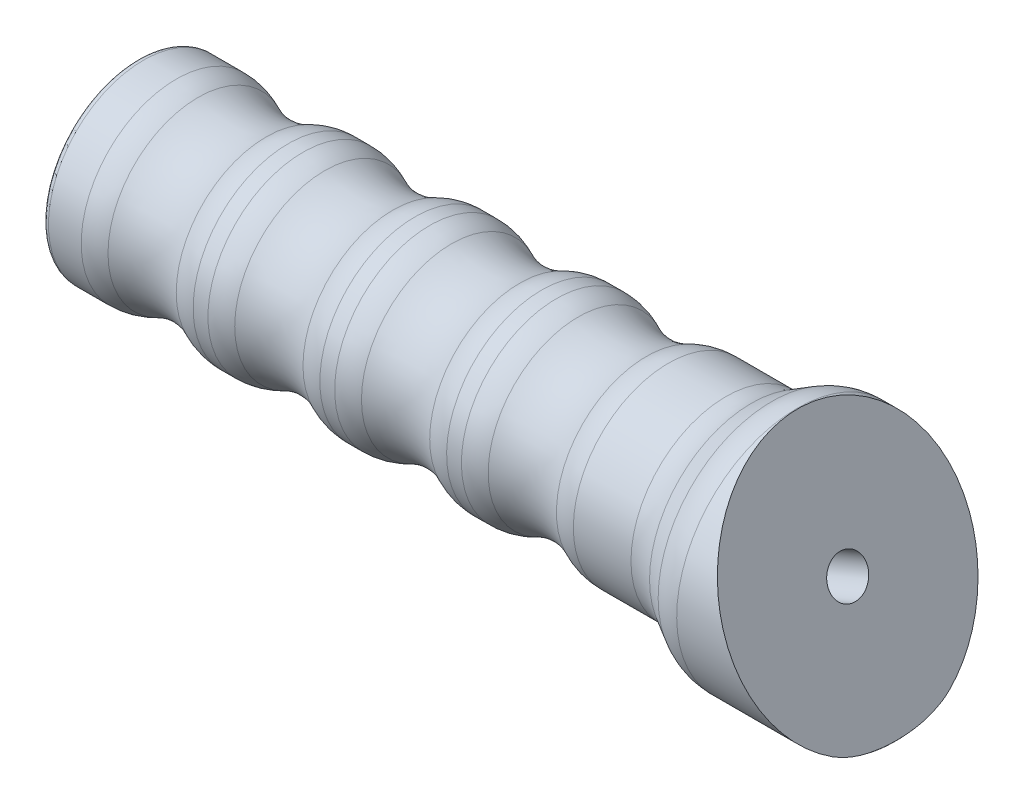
from build123d import *

# Parameters (mm, degrees)
CONG_1_R                            = 1
CONG_2_R                            = 8
ENL_V_MAT_EXTRU_1_DEPTH             = 123.971541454
ENL_V_MAT_EXTRU_1_DEPTH_BACK        = 123.971541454
DIAM_TRE_DU_PER_AGE_6_2_6_2_1_D     = 6.2
DIAM_TRE_DU_PER_AGE_6_2_6_2_1_DEPTH = 30
DIAM_TRE_DU_PER_AGE_6_2_6_2_1_TIP   = 1.862667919
ESQUISSE5_R                         = 5.5
ENL_V_MAT_EXTRU_2_DEPTH             = 37


with BuildPart() as part:
    # Esquisse1 → R_volution1 (revolve)
    with BuildSketch(Plane.XY, mode=Mode.PRIVATE) as r_volution1_sk:
        with BuildLine():
            Line((0, 0), (0, 15))
            Line((0, 15), (8.217670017, 15))
            ThreePointArc((8.217670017, 15), (15, 13), (21.782329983, 15))
            Line((21.782329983, 15), (28.217670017, 15))
            ThreePointArc((28.217670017, 15), (35, 13), (41.782329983, 15))
            Line((41.782329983, 15), (48.217670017, 15))
            ThreePointArc((48.217670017, 15), (55, 13), (61.782329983, 15))
            Line((61.782329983, 15), (68.217670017, 15))
            ThreePointArc((68.217670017, 15), (75, 13), (81.782329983, 15))
            Line((81.782329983, 15), (95.07179677, 15))
            Line((95.07179677, 15), (102, 19))
            Line((102, 19), (120, 19))
            Line((120, 19), (120, 0))
            Line((120, 0), (0, 0))
        make_face()
    revolve(r_volution1_sk.sketch.rotate(Axis((0, 0, 0), (1, 0, 0)), 90), axis=Axis((0, 0, 0), (1, 0, 0)))

    # Cong_1
    cong_1_edges = [part.edges().sort_by_distance(p)[0] for p in [
        (120, 0, -19),
        (0, 0, -15),
    ]]
    fillet(cong_1_edges, radius=CONG_1_R)

    # Cong_2
    cong_2_edges = [part.edges().sort_by_distance(p)[0] for p in [
        (8.217670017, 0, -15),
        (21.782329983, 0, -15),
        (28.217670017, 0, -15),
        (41.782329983, 0, -15),
        (48.217670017, 0, -15),
        (61.782329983, 0, -15),
        (68.217670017, 0, -15),
        (81.782329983, 0, -15),
        (95.07179677, 0, -15),
        (102, 0, -19),
    ]]
    fillet(cong_2_edges, radius=CONG_2_R)

    # Esquisse2 → Enl_v. mat.-Extru.1 (cut, two sides: drawn at the far end of the back side and taken through both)
    with BuildSketch(Plane.XY.offset(-ENL_V_MAT_EXTRU_1_DEPTH_BACK)):
        with BuildLine():
            Line((120, -19), (120, 18))
            ThreePointArc((120, 18), (119.707106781, 18.707106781), (119, 19))
            Line((119, 19), (104.25988463, 19))
            Line((104.25988463, 19), (120, -19))
        make_face()
    extrude(amount=ENL_V_MAT_EXTRU_1_DEPTH + ENL_V_MAT_EXTRU_1_DEPTH_BACK, mode=Mode.SUBTRACT)

    # Diam_tre du per_age _6.2 _6.2_1
    with Locations(Plane(origin=(95.70889245, 39.643921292, 0), x_dir=(0, 0, -1), z_dir=(0.9238795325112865, 0.3826834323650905, 0))):
        with Locations((0, -42.910271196)):
            Hole(DIAM_TRE_DU_PER_AGE_6_2_6_2_1_D / 2, depth=DIAM_TRE_DU_PER_AGE_6_2_6_2_1_DEPTH)
            with Locations((0, 0, -(DIAM_TRE_DU_PER_AGE_6_2_6_2_1_DEPTH + DIAM_TRE_DU_PER_AGE_6_2_6_2_1_TIP / 2))):  # 118° drill point
                Cone(0, DIAM_TRE_DU_PER_AGE_6_2_6_2_1_D / 2, DIAM_TRE_DU_PER_AGE_6_2_6_2_1_TIP, mode=Mode.SUBTRACT)

    # Esquisse5 → Enl_v. mat.-Extru.2 (cut)
    with BuildSketch(Plane(origin=(44.895518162, 18.596332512, 0), x_dir=(0, 0, -1), z_dir=(0.9238795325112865, 0.3826834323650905, 0))):
        with Locations(Location((0, -42.910271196, 0), (0, 0, 336.115995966))):
            Circle(ESQUISSE5_R)
    extrude(amount=ENL_V_MAT_EXTRU_2_DEPTH, mode=Mode.SUBTRACT)


solid = part.part
